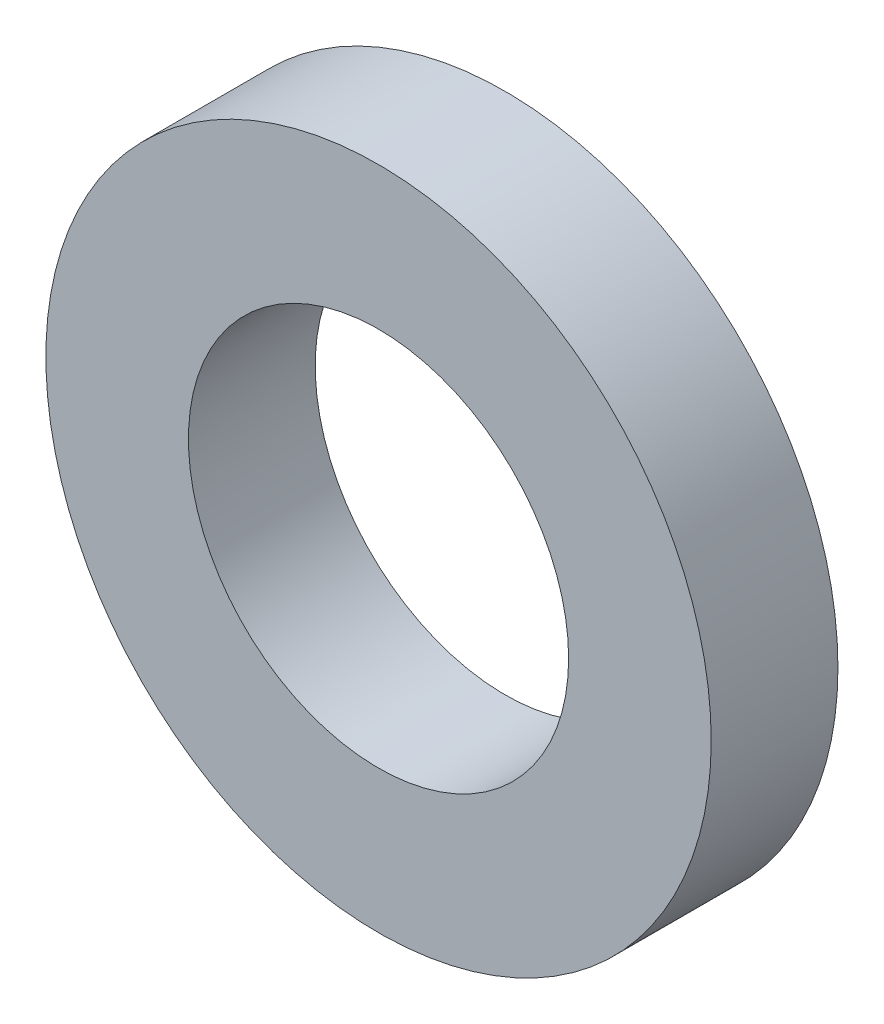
ISO-10303-21;
HEADER;
FILE_DESCRIPTION(('STEP AP214'),'2;1');
FILE_NAME('part.step','',(''),(''),'','','');
FILE_SCHEMA(('AUTOMOTIVE_DESIGN { 1 0 10303 214 1 1 1 1 }'));
ENDSEC;
DATA;
#1=APPLICATION_CONTEXT('core data for automotive mechanical design processes');
#2=APPLICATION_PROTOCOL_DEFINITION('international standard','automotive_design',2000,#1);
#3=PRODUCT_CONTEXT('',#1,'mechanical');
#4=PRODUCT('Part','Part','',(#3));
#5=PRODUCT_RELATED_PRODUCT_CATEGORY('part','',(#4));
#6=PRODUCT_DEFINITION_FORMATION('','',#4);
#7=PRODUCT_DEFINITION_CONTEXT('part definition',#1,'design');
#8=PRODUCT_DEFINITION('design','',#6,#7);
#9=PRODUCT_DEFINITION_SHAPE('','',#8);
#10=(LENGTH_UNIT() NAMED_UNIT(*) SI_UNIT(.MILLI.,.METRE.));
#11=(NAMED_UNIT(*) PLANE_ANGLE_UNIT() SI_UNIT($,.RADIAN.));
#12=(NAMED_UNIT(*) SI_UNIT($,.STERADIAN.) SOLID_ANGLE_UNIT());
#13=UNCERTAINTY_MEASURE_WITH_UNIT(LENGTH_MEASURE(1.E-05),#10,'distance_accuracy_value','');
#14=(GEOMETRIC_REPRESENTATION_CONTEXT(3) GLOBAL_UNCERTAINTY_ASSIGNED_CONTEXT((#13)) GLOBAL_UNIT_ASSIGNED_CONTEXT((#10,
#11,#12)) REPRESENTATION_CONTEXT('',''));
#15=CARTESIAN_POINT('',(0.,0.,0.));
#16=DIRECTION('',(0.,0.,1.));
#17=DIRECTION('',(1.,0.,0.));
#18=AXIS2_PLACEMENT_3D('',#15,#16,#17);
#19=CARTESIAN_POINT('',(0.,0.,2.));
#20=DIRECTION('',(0.,0.,1.));
#21=DIRECTION('',(1.,0.,0.));
#22=AXIS2_PLACEMENT_3D('',#19,#20,#21);
#23=PLANE('',#22);
#24=CARTESIAN_POINT('',(0.,0.,2.));
#25=DIRECTION('',(0.,0.,1.));
#26=DIRECTION('',(1.,0.,0.));
#27=AXIS2_PLACEMENT_3D('',#24,#25,#26);
#28=CIRCLE('',#27,5.25);
#29=CARTESIAN_POINT('',(5.25,0.,2.));
#30=VERTEX_POINT('',#29);
#31=EDGE_CURVE('E11',#30,#30,#28,.T.);
#32=ORIENTED_EDGE('',*,*,#31,.T.);
#33=EDGE_LOOP('',(#32));
#34=FACE_BOUND('',#33,.T.);
#35=CARTESIAN_POINT('',(0.,0.,2.));
#36=DIRECTION('',(0.,0.,1.));
#37=DIRECTION('',(1.,0.,0.));
#38=AXIS2_PLACEMENT_3D('',#35,#36,#37);
#39=CIRCLE('',#38,3.);
#40=CARTESIAN_POINT('',(3.,0.,2.));
#41=VERTEX_POINT('',#40);
#42=EDGE_CURVE('E61',#41,#41,#39,.T.);
#43=ORIENTED_EDGE('',*,*,#42,.F.);
#44=EDGE_LOOP('',(#43));
#45=FACE_BOUND('',#44,.T.);
#46=ADVANCED_FACE('F46',(#34,#45),#23,.T.);
#47=CARTESIAN_POINT('',(0.,0.,0.));
#48=DIRECTION('',(0.,0.,1.));
#49=DIRECTION('',(1.,0.,0.));
#50=AXIS2_PLACEMENT_3D('',#47,#48,#49);
#51=PLANE('',#50);
#52=CARTESIAN_POINT('',(0.,0.,0.));
#53=DIRECTION('',(0.,0.,1.));
#54=DIRECTION('',(1.,0.,0.));
#55=AXIS2_PLACEMENT_3D('',#52,#53,#54);
#56=CIRCLE('',#55,5.25);
#57=CARTESIAN_POINT('',(5.25,0.,0.));
#58=VERTEX_POINT('',#57);
#59=EDGE_CURVE('E55',#58,#58,#56,.T.);
#60=ORIENTED_EDGE('',*,*,#59,.F.);
#61=EDGE_LOOP('',(#60));
#62=FACE_BOUND('',#61,.T.);
#63=CARTESIAN_POINT('',(0.,0.,0.));
#64=DIRECTION('',(0.,0.,1.));
#65=DIRECTION('',(1.,0.,0.));
#66=AXIS2_PLACEMENT_3D('',#63,#64,#65);
#67=CIRCLE('',#66,3.);
#68=CARTESIAN_POINT('',(3.,0.,0.));
#69=VERTEX_POINT('',#68);
#70=EDGE_CURVE('E50',#69,#69,#67,.T.);
#71=ORIENTED_EDGE('',*,*,#70,.T.);
#72=EDGE_LOOP('',(#71));
#73=FACE_BOUND('',#72,.T.);
#74=ADVANCED_FACE('F71',(#62,#73),#51,.F.);
#75=CARTESIAN_POINT('',(0.,0.,2.));
#76=DIRECTION('',(0.,0.,-1.));
#77=DIRECTION('',(-1.,0.,0.));
#78=AXIS2_PLACEMENT_3D('',#75,#76,#77);
#79=CYLINDRICAL_SURFACE('',#78,5.25);
#80=ORIENTED_EDGE('',*,*,#31,.F.);
#81=EDGE_LOOP('',(#80));
#82=FACE_BOUND('',#81,.T.);
#83=ORIENTED_EDGE('',*,*,#59,.T.);
#84=EDGE_LOOP('',(#83));
#85=FACE_BOUND('',#84,.T.);
#86=ADVANCED_FACE('F74',(#82,#85),#79,.T.);
#87=CARTESIAN_POINT('',(0.,0.,2.));
#88=DIRECTION('',(0.,0.,-1.));
#89=DIRECTION('',(-1.,0.,0.));
#90=AXIS2_PLACEMENT_3D('',#87,#88,#89);
#91=CYLINDRICAL_SURFACE('',#90,3.);
#92=ORIENTED_EDGE('',*,*,#42,.T.);
#93=EDGE_LOOP('',(#92));
#94=FACE_BOUND('',#93,.T.);
#95=ORIENTED_EDGE('',*,*,#70,.F.);
#96=EDGE_LOOP('',(#95));
#97=FACE_BOUND('',#96,.T.);
#98=ADVANCED_FACE('F48',(#94,#97),#91,.F.);
#99=CLOSED_SHELL('',(#46,#74,#86,#98));
#100=MANIFOLD_SOLID_BREP('B2',#99);
#101=ADVANCED_BREP_SHAPE_REPRESENTATION('',(#18,#100),#14);
#102=SHAPE_DEFINITION_REPRESENTATION(#9,#101);
ENDSEC;
END-ISO-10303-21;
